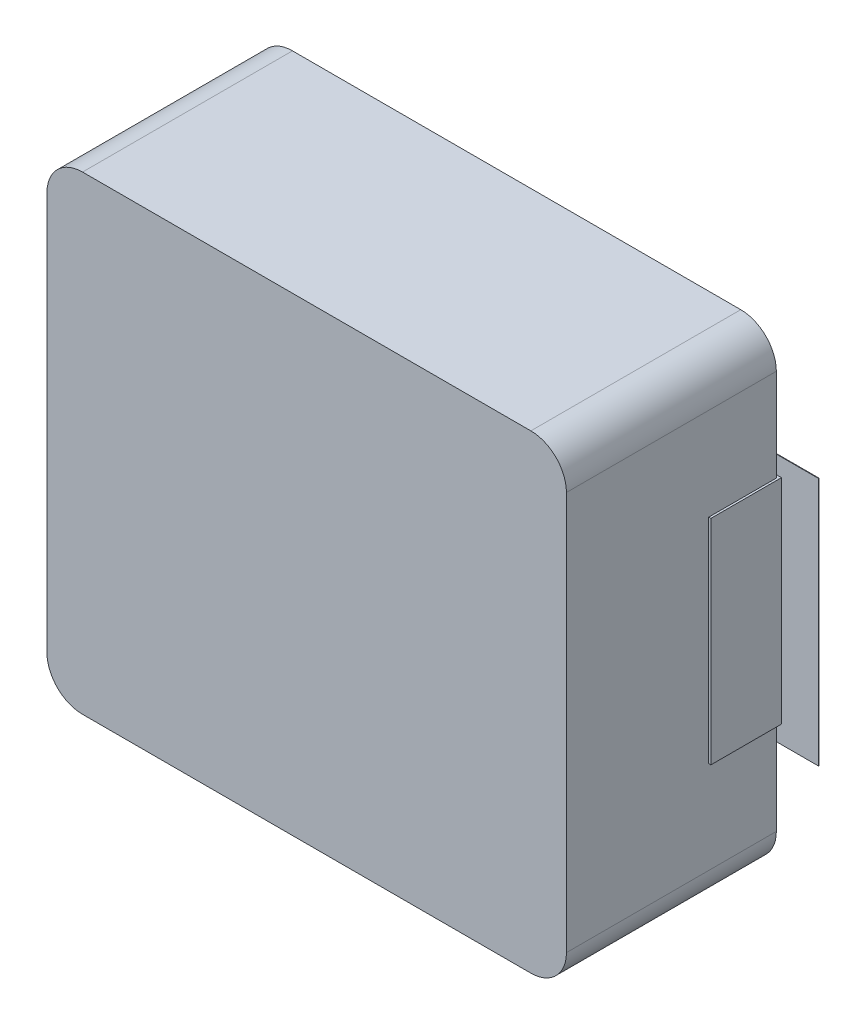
ISO-10303-21;
HEADER;
FILE_DESCRIPTION(('STEP AP214'),'2;1');
FILE_NAME('part.step','',(''),(''),'','','');
FILE_SCHEMA(('AUTOMOTIVE_DESIGN { 1 0 10303 214 1 1 1 1 }'));
ENDSEC;
DATA;
#1=APPLICATION_CONTEXT('core data for automotive mechanical design processes');
#2=APPLICATION_PROTOCOL_DEFINITION('international standard','automotive_design',2000,#1);
#3=PRODUCT_CONTEXT('',#1,'mechanical');
#4=PRODUCT('Part','Part','',(#3));
#5=PRODUCT_RELATED_PRODUCT_CATEGORY('part','',(#4));
#6=PRODUCT_DEFINITION_FORMATION('','',#4);
#7=PRODUCT_DEFINITION_CONTEXT('part definition',#1,'design');
#8=PRODUCT_DEFINITION('design','',#6,#7);
#9=PRODUCT_DEFINITION_SHAPE('','',#8);
#10=(LENGTH_UNIT() NAMED_UNIT(*) SI_UNIT(.MILLI.,.METRE.));
#11=(NAMED_UNIT(*) PLANE_ANGLE_UNIT() SI_UNIT($,.RADIAN.));
#12=(NAMED_UNIT(*) SI_UNIT($,.STERADIAN.) SOLID_ANGLE_UNIT());
#13=UNCERTAINTY_MEASURE_WITH_UNIT(LENGTH_MEASURE(1.E-05),#10,'distance_accuracy_value','');
#14=(GEOMETRIC_REPRESENTATION_CONTEXT(3) GLOBAL_UNCERTAINTY_ASSIGNED_CONTEXT((#13)) GLOBAL_UNIT_ASSIGNED_CONTEXT((#10,
#11,#12)) REPRESENTATION_CONTEXT('',''));
#15=CARTESIAN_POINT('',(0.,0.,0.));
#16=DIRECTION('',(0.,0.,1.));
#17=DIRECTION('',(1.,0.,0.));
#18=AXIS2_PLACEMENT_3D('',#15,#16,#17);
#19=CARTESIAN_POINT('',(0.,0.,0.0762));
#20=DIRECTION('',(0.,0.,1.));
#21=DIRECTION('',(1.,0.,0.));
#22=AXIS2_PLACEMENT_3D('',#19,#20,#21);
#23=PLANE('',#22);
#24=DIRECTION('',(1.,0.,0.));
#25=VECTOR('',#24,1.);
#26=CARTESIAN_POINT('',(-1.25000000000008,1.75000000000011,0.0762));
#27=LINE('',#26,#25);
#28=CARTESIAN_POINT('',(-1.25000000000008,1.75000000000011,0.0762));
#29=VERTEX_POINT('',#28);
#30=CARTESIAN_POINT('',(-4.20000000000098,1.75000000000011,0.0762));
#31=VERTEX_POINT('',#30);
#32=EDGE_CURVE('E198',#29,#31,#27,.F.);
#33=ORIENTED_EDGE('',*,*,#32,.F.);
#34=DIRECTION('',(0.,1.,0.));
#35=VECTOR('',#34,1.);
#36=CARTESIAN_POINT('',(-1.25000000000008,-1.75000000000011,0.0762));
#37=LINE('',#36,#35);
#38=CARTESIAN_POINT('',(-1.25000000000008,-1.75000000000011,0.0762));
#39=VERTEX_POINT('',#38);
#40=EDGE_CURVE('E203',#39,#29,#37,.T.);
#41=ORIENTED_EDGE('',*,*,#40,.F.);
#42=DIRECTION('',(1.,0.,0.));
#43=VECTOR('',#42,1.);
#44=CARTESIAN_POINT('',(-4.20000000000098,-1.75000000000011,0.0762));
#45=LINE('',#44,#43);
#46=CARTESIAN_POINT('',(-4.20000000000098,-1.75000000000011,0.0762));
#47=VERTEX_POINT('',#46);
#48=EDGE_CURVE('E295',#47,#39,#45,.T.);
#49=ORIENTED_EDGE('',*,*,#48,.F.);
#50=DIRECTION('',(0.,1.,0.));
#51=VECTOR('',#50,1.);
#52=CARTESIAN_POINT('',(-4.20000000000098,1.75000000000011,0.0762));
#53=LINE('',#52,#51);
#54=EDGE_CURVE('E213',#31,#47,#53,.F.);
#55=ORIENTED_EDGE('',*,*,#54,.F.);
#56=EDGE_LOOP('',(#33,#41,#49,#55));
#57=FACE_BOUND('',#56,.T.);
#58=ADVANCED_FACE('F16',(#57),#23,.F.);
#59=CARTESIAN_POINT('',(0.,0.,0.0762));
#60=DIRECTION('',(0.,0.,1.));
#61=DIRECTION('',(1.,0.,0.));
#62=AXIS2_PLACEMENT_3D('',#59,#60,#61);
#63=PLANE('',#62);
#64=DIRECTION('',(1.,0.,0.));
#65=VECTOR('',#64,1.);
#66=CARTESIAN_POINT('',(4.20000000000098,1.75000000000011,0.0762));
#67=LINE('',#66,#65);
#68=CARTESIAN_POINT('',(4.20000000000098,1.75000000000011,0.0762));
#69=VERTEX_POINT('',#68);
#70=CARTESIAN_POINT('',(1.25000000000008,1.75000000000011,0.0762));
#71=VERTEX_POINT('',#70);
#72=EDGE_CURVE('E288',#69,#71,#67,.F.);
#73=ORIENTED_EDGE('',*,*,#72,.F.);
#74=DIRECTION('',(0.,1.,0.));
#75=VECTOR('',#74,1.);
#76=CARTESIAN_POINT('',(4.20000000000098,-1.75000000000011,0.0762));
#77=LINE('',#76,#75);
#78=CARTESIAN_POINT('',(4.20000000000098,-1.75000000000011,0.0762));
#79=VERTEX_POINT('',#78);
#80=EDGE_CURVE('E293',#79,#69,#77,.T.);
#81=ORIENTED_EDGE('',*,*,#80,.F.);
#82=DIRECTION('',(1.,0.,0.));
#83=VECTOR('',#82,1.);
#84=CARTESIAN_POINT('',(1.25000000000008,-1.75000000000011,0.0762));
#85=LINE('',#84,#83);
#86=CARTESIAN_POINT('',(1.25000000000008,-1.75000000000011,0.0762));
#87=VERTEX_POINT('',#86);
#88=EDGE_CURVE('E273',#87,#79,#85,.T.);
#89=ORIENTED_EDGE('',*,*,#88,.F.);
#90=DIRECTION('',(0.,1.,0.));
#91=VECTOR('',#90,1.);
#92=CARTESIAN_POINT('',(1.25000000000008,1.75000000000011,0.0762));
#93=LINE('',#92,#91);
#94=EDGE_CURVE('E283',#71,#87,#93,.F.);
#95=ORIENTED_EDGE('',*,*,#94,.F.);
#96=EDGE_LOOP('',(#73,#81,#89,#95));
#97=FACE_BOUND('',#96,.T.);
#98=ADVANCED_FACE('F637',(#97),#63,.F.);
#99=CARTESIAN_POINT('',(-1.25000000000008,-1.75000000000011,0.0762));
#100=DIRECTION('',(1.,0.,0.));
#101=DIRECTION('',(0.,0.,-1.));
#102=AXIS2_PLACEMENT_3D('',#99,#100,#101);
#103=PLANE('',#102);
#104=DIRECTION('',(0.,0.,-1.));
#105=VECTOR('',#104,1.);
#106=CARTESIAN_POINT('',(-1.25000000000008,-1.75000000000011,0.0762));
#107=LINE('',#106,#105);
#108=CARTESIAN_POINT('',(-1.25000000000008,-1.75000000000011,0.0841999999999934));
#109=VERTEX_POINT('',#108);
#110=EDGE_CURVE('E208',#39,#109,#107,.F.);
#111=ORIENTED_EDGE('',*,*,#110,.F.);
#112=ORIENTED_EDGE('',*,*,#40,.T.);
#113=DIRECTION('',(0.,0.,1.));
#114=VECTOR('',#113,1.);
#115=CARTESIAN_POINT('',(-1.25000000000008,1.75000000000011,0.0762));
#116=LINE('',#115,#114);
#117=CARTESIAN_POINT('',(-1.25000000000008,1.75000000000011,0.0841999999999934));
#118=VERTEX_POINT('',#117);
#119=EDGE_CURVE('E205',#118,#29,#116,.F.);
#120=ORIENTED_EDGE('',*,*,#119,.F.);
#121=DIRECTION('',(0.,1.,0.));
#122=VECTOR('',#121,1.);
#123=CARTESIAN_POINT('',(-1.25000000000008,0.,0.0841999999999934));
#124=LINE('',#123,#122);
#125=EDGE_CURVE('E276',#109,#118,#124,.T.);
#126=ORIENTED_EDGE('',*,*,#125,.F.);
#127=EDGE_LOOP('',(#111,#112,#120,#126));
#128=FACE_BOUND('',#127,.T.);
#129=ADVANCED_FACE('F204',(#128),#103,.T.);
#130=CARTESIAN_POINT('',(-1.25000000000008,1.75000000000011,0.0762));
#131=DIRECTION('',(0.,1.,0.));
#132=DIRECTION('',(0.,0.,1.));
#133=AXIS2_PLACEMENT_3D('',#130,#131,#132);
#134=PLANE('',#133);
#135=ORIENTED_EDGE('',*,*,#119,.T.);
#136=ORIENTED_EDGE('',*,*,#32,.T.);
#137=DIRECTION('',(0.,0.,1.));
#138=VECTOR('',#137,1.);
#139=CARTESIAN_POINT('',(-4.20000000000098,1.75000000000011,0.0762));
#140=LINE('',#139,#138);
#141=CARTESIAN_POINT('',(-4.20000000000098,1.75000000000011,0.0841999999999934));
#142=VERTEX_POINT('',#141);
#143=EDGE_CURVE('E215',#142,#31,#140,.F.);
#144=ORIENTED_EDGE('',*,*,#143,.F.);
#145=DIRECTION('',(1.,0.,0.));
#146=VECTOR('',#145,1.);
#147=CARTESIAN_POINT('',(0.,1.75000000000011,0.0841999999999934));
#148=LINE('',#147,#146);
#149=EDGE_CURVE('E219',#118,#142,#148,.F.);
#150=ORIENTED_EDGE('',*,*,#149,.F.);
#151=EDGE_LOOP('',(#135,#136,#144,#150));
#152=FACE_BOUND('',#151,.T.);
#153=ADVANCED_FACE('F217',(#152),#134,.T.);
#154=CARTESIAN_POINT('',(-4.20000000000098,1.75000000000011,0.0762));
#155=DIRECTION('',(-1.,0.,0.));
#156=DIRECTION('',(0.,0.,1.));
#157=AXIS2_PLACEMENT_3D('',#154,#155,#156);
#158=PLANE('',#157);
#159=ORIENTED_EDGE('',*,*,#143,.T.);
#160=ORIENTED_EDGE('',*,*,#54,.T.);
#161=DIRECTION('',(0.,0.,-1.));
#162=VECTOR('',#161,1.);
#163=CARTESIAN_POINT('',(-4.20000000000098,-1.75000000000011,0.0762));
#164=LINE('',#163,#162);
#165=CARTESIAN_POINT('',(-4.20000000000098,-1.75000000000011,0.0841999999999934));
#166=VERTEX_POINT('',#165);
#167=EDGE_CURVE('E297',#166,#47,#164,.T.);
#168=ORIENTED_EDGE('',*,*,#167,.F.);
#169=DIRECTION('',(0.,1.,0.));
#170=VECTOR('',#169,1.);
#171=CARTESIAN_POINT('',(-4.20000000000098,0.,0.0841999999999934));
#172=LINE('',#171,#170);
#173=EDGE_CURVE('E305',#142,#166,#172,.F.);
#174=ORIENTED_EDGE('',*,*,#173,.F.);
#175=EDGE_LOOP('',(#159,#160,#168,#174));
#176=FACE_BOUND('',#175,.T.);
#177=ADVANCED_FACE('F303',(#176),#158,.T.);
#178=CARTESIAN_POINT('',(-4.20000000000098,-1.75000000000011,0.0762));
#179=DIRECTION('',(0.,-1.,0.));
#180=DIRECTION('',(0.,0.,-1.));
#181=AXIS2_PLACEMENT_3D('',#178,#179,#180);
#182=PLANE('',#181);
#183=ORIENTED_EDGE('',*,*,#167,.T.);
#184=ORIENTED_EDGE('',*,*,#48,.T.);
#185=ORIENTED_EDGE('',*,*,#110,.T.);
#186=DIRECTION('',(1.,0.,0.));
#187=VECTOR('',#186,1.);
#188=CARTESIAN_POINT('',(0.,-1.75000000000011,0.0841999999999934));
#189=LINE('',#188,#187);
#190=EDGE_CURVE('E309',#166,#109,#189,.T.);
#191=ORIENTED_EDGE('',*,*,#190,.F.);
#192=EDGE_LOOP('',(#183,#184,#185,#191));
#193=FACE_BOUND('',#192,.T.);
#194=ADVANCED_FACE('F421',(#193),#182,.T.);
#195=CARTESIAN_POINT('',(4.20000000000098,-1.75000000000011,0.0762));
#196=DIRECTION('',(1.,0.,0.));
#197=DIRECTION('',(0.,0.,-1.));
#198=AXIS2_PLACEMENT_3D('',#195,#196,#197);
#199=PLANE('',#198);
#200=DIRECTION('',(0.,0.,-1.));
#201=VECTOR('',#200,1.);
#202=CARTESIAN_POINT('',(4.20000000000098,-1.75000000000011,0.0762));
#203=LINE('',#202,#201);
#204=CARTESIAN_POINT('',(4.20000000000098,-1.75000000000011,0.0841999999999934));
#205=VERTEX_POINT('',#204);
#206=EDGE_CURVE('E280',#79,#205,#203,.F.);
#207=ORIENTED_EDGE('',*,*,#206,.F.);
#208=ORIENTED_EDGE('',*,*,#80,.T.);
#209=DIRECTION('',(0.,0.,1.));
#210=VECTOR('',#209,1.);
#211=CARTESIAN_POINT('',(4.20000000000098,1.75000000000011,0.0762));
#212=LINE('',#211,#210);
#213=CARTESIAN_POINT('',(4.20000000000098,1.75000000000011,0.0841999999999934));
#214=VERTEX_POINT('',#213);
#215=EDGE_CURVE('E290',#214,#69,#212,.F.);
#216=ORIENTED_EDGE('',*,*,#215,.F.);
#217=DIRECTION('',(0.,1.,0.));
#218=VECTOR('',#217,1.);
#219=CARTESIAN_POINT('',(4.20000000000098,0.,0.0841999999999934));
#220=LINE('',#219,#218);
#221=EDGE_CURVE('E389',#205,#214,#220,.T.);
#222=ORIENTED_EDGE('',*,*,#221,.F.);
#223=EDGE_LOOP('',(#207,#208,#216,#222));
#224=FACE_BOUND('',#223,.T.);
#225=ADVANCED_FACE('F423',(#224),#199,.T.);
#226=CARTESIAN_POINT('',(4.20000000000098,1.75000000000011,0.0762));
#227=DIRECTION('',(0.,1.,0.));
#228=DIRECTION('',(0.,0.,1.));
#229=AXIS2_PLACEMENT_3D('',#226,#227,#228);
#230=PLANE('',#229);
#231=ORIENTED_EDGE('',*,*,#215,.T.);
#232=ORIENTED_EDGE('',*,*,#72,.T.);
#233=DIRECTION('',(0.,0.,1.));
#234=VECTOR('',#233,1.);
#235=CARTESIAN_POINT('',(1.25000000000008,1.75000000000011,0.0762));
#236=LINE('',#235,#234);
#237=CARTESIAN_POINT('',(1.25000000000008,1.75000000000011,0.0841999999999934));
#238=VERTEX_POINT('',#237);
#239=EDGE_CURVE('E285',#238,#71,#236,.F.);
#240=ORIENTED_EDGE('',*,*,#239,.F.);
#241=DIRECTION('',(1.,0.,0.));
#242=VECTOR('',#241,1.);
#243=CARTESIAN_POINT('',(0.,1.75000000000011,0.0841999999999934));
#244=LINE('',#243,#242);
#245=EDGE_CURVE('E386',#214,#238,#244,.F.);
#246=ORIENTED_EDGE('',*,*,#245,.F.);
#247=EDGE_LOOP('',(#231,#232,#240,#246));
#248=FACE_BOUND('',#247,.T.);
#249=ADVANCED_FACE('F430',(#248),#230,.T.);
#250=CARTESIAN_POINT('',(1.25000000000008,1.75000000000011,0.0762));
#251=DIRECTION('',(-1.,0.,0.));
#252=DIRECTION('',(0.,0.,1.));
#253=AXIS2_PLACEMENT_3D('',#250,#251,#252);
#254=PLANE('',#253);
#255=ORIENTED_EDGE('',*,*,#239,.T.);
#256=ORIENTED_EDGE('',*,*,#94,.T.);
#257=DIRECTION('',(0.,0.,-1.));
#258=VECTOR('',#257,1.);
#259=CARTESIAN_POINT('',(1.25000000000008,-1.75000000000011,0.0762));
#260=LINE('',#259,#258);
#261=CARTESIAN_POINT('',(1.25000000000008,-1.75000000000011,0.0841999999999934));
#262=VERTEX_POINT('',#261);
#263=EDGE_CURVE('E277',#262,#87,#260,.T.);
#264=ORIENTED_EDGE('',*,*,#263,.F.);
#265=DIRECTION('',(0.,1.,0.));
#266=VECTOR('',#265,1.);
#267=CARTESIAN_POINT('',(1.25000000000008,0.,0.0841999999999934));
#268=LINE('',#267,#266);
#269=EDGE_CURVE('E383',#238,#262,#268,.F.);
#270=ORIENTED_EDGE('',*,*,#269,.F.);
#271=EDGE_LOOP('',(#255,#256,#264,#270));
#272=FACE_BOUND('',#271,.T.);
#273=ADVANCED_FACE('F519',(#272),#254,.T.);
#274=CARTESIAN_POINT('',(1.25000000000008,-1.75000000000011,0.0762));
#275=DIRECTION('',(0.,-1.,0.));
#276=DIRECTION('',(0.,0.,-1.));
#277=AXIS2_PLACEMENT_3D('',#274,#275,#276);
#278=PLANE('',#277);
#279=ORIENTED_EDGE('',*,*,#263,.T.);
#280=ORIENTED_EDGE('',*,*,#88,.T.);
#281=ORIENTED_EDGE('',*,*,#206,.T.);
#282=DIRECTION('',(1.,0.,0.));
#283=VECTOR('',#282,1.);
#284=CARTESIAN_POINT('',(0.,-1.75000000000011,0.0841999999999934));
#285=LINE('',#284,#283);
#286=EDGE_CURVE('E380',#262,#205,#285,.T.);
#287=ORIENTED_EDGE('',*,*,#286,.F.);
#288=EDGE_LOOP('',(#279,#280,#281,#287));
#289=FACE_BOUND('',#288,.T.);
#290=ADVANCED_FACE('F515',(#289),#278,.T.);
#291=CARTESIAN_POINT('',(0.,0.,0.0841999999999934));
#292=DIRECTION('',(0.,0.,1.));
#293=DIRECTION('',(1.,0.,0.));
#294=AXIS2_PLACEMENT_3D('',#291,#292,#293);
#295=PLANE('',#294);
#296=DIRECTION('',(0.,1.,0.));
#297=VECTOR('',#296,1.);
#298=CARTESIAN_POINT('',(-1.8800000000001,-1.5000000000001,0.0841999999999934));
#299=LINE('',#298,#297);
#300=CARTESIAN_POINT('',(-1.8800000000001,-1.5000000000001,0.0841999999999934));
#301=VERTEX_POINT('',#300);
#302=CARTESIAN_POINT('',(-1.8800000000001,1.5000000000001,0.0841999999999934));
#303=VERTEX_POINT('',#302);
#304=EDGE_CURVE('E327',#301,#303,#299,.T.);
#305=ORIENTED_EDGE('',*,*,#304,.F.);
#306=DIRECTION('',(1.,0.,0.));
#307=VECTOR('',#306,1.);
#308=CARTESIAN_POINT('',(-3.68000000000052,-1.5000000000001,0.0841999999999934));
#309=LINE('',#308,#307);
#310=CARTESIAN_POINT('',(-3.68000000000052,-1.5000000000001,0.0841999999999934));
#311=VERTEX_POINT('',#310);
#312=EDGE_CURVE('E269',#311,#301,#309,.T.);
#313=ORIENTED_EDGE('',*,*,#312,.F.);
#314=DIRECTION('',(0.,1.,0.));
#315=VECTOR('',#314,1.);
#316=CARTESIAN_POINT('',(-3.68000000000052,1.5000000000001,0.0841999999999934));
#317=LINE('',#316,#315);
#318=CARTESIAN_POINT('',(-3.68000000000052,1.5000000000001,0.0841999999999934));
#319=VERTEX_POINT('',#318);
#320=EDGE_CURVE('E352',#319,#311,#317,.F.);
#321=ORIENTED_EDGE('',*,*,#320,.F.);
#322=DIRECTION('',(1.,0.,0.));
#323=VECTOR('',#322,1.);
#324=CARTESIAN_POINT('',(-1.8800000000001,1.5000000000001,0.0841999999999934));
#325=LINE('',#324,#323);
#326=EDGE_CURVE('E339',#303,#319,#325,.F.);
#327=ORIENTED_EDGE('',*,*,#326,.F.);
#328=EDGE_LOOP('',(#305,#313,#321,#327));
#329=FACE_BOUND('',#328,.T.);
#330=ORIENTED_EDGE('',*,*,#173,.T.);
#331=ORIENTED_EDGE('',*,*,#190,.T.);
#332=ORIENTED_EDGE('',*,*,#125,.T.);
#333=ORIENTED_EDGE('',*,*,#149,.T.);
#334=EDGE_LOOP('',(#330,#331,#332,#333));
#335=FACE_BOUND('',#334,.T.);
#336=ADVANCED_FACE('F311',(#329,#335),#295,.T.);
#337=CARTESIAN_POINT('',(0.,0.,0.0841999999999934));
#338=DIRECTION('',(0.,0.,1.));
#339=DIRECTION('',(1.,0.,0.));
#340=AXIS2_PLACEMENT_3D('',#337,#338,#339);
#341=PLANE('',#340);
#342=DIRECTION('',(1.,0.,0.));
#343=VECTOR('',#342,1.);
#344=CARTESIAN_POINT('',(3.68000000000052,1.5000000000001,0.0841999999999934));
#345=LINE('',#344,#343);
#346=CARTESIAN_POINT('',(3.68000000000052,1.5000000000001,0.0841999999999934));
#347=VERTEX_POINT('',#346);
#348=CARTESIAN_POINT('',(1.8800000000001,1.5000000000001,0.0841999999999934));
#349=VERTEX_POINT('',#348);
#350=EDGE_CURVE('E347',#347,#349,#345,.F.);
#351=ORIENTED_EDGE('',*,*,#350,.F.);
#352=DIRECTION('',(0.,1.,0.));
#353=VECTOR('',#352,1.);
#354=CARTESIAN_POINT('',(3.68000000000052,-1.5000000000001,0.0841999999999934));
#355=LINE('',#354,#353);
#356=CARTESIAN_POINT('',(3.68000000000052,-1.5000000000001,0.0841999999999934));
#357=VERTEX_POINT('',#356);
#358=EDGE_CURVE('E355',#357,#347,#355,.T.);
#359=ORIENTED_EDGE('',*,*,#358,.F.);
#360=DIRECTION('',(1.,0.,0.));
#361=VECTOR('',#360,1.);
#362=CARTESIAN_POINT('',(1.8800000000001,-1.5000000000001,0.0841999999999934));
#363=LINE('',#362,#361);
#364=CARTESIAN_POINT('',(1.8800000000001,-1.5000000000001,0.0841999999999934));
#365=VERTEX_POINT('',#364);
#366=EDGE_CURVE('E398',#365,#357,#363,.T.);
#367=ORIENTED_EDGE('',*,*,#366,.F.);
#368=DIRECTION('',(0.,1.,0.));
#369=VECTOR('',#368,1.);
#370=CARTESIAN_POINT('',(1.8800000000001,1.5000000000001,0.0841999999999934));
#371=LINE('',#370,#369);
#372=EDGE_CURVE('E376',#349,#365,#371,.F.);
#373=ORIENTED_EDGE('',*,*,#372,.F.);
#374=EDGE_LOOP('',(#351,#359,#367,#373));
#375=FACE_BOUND('',#374,.T.);
#376=ORIENTED_EDGE('',*,*,#269,.T.);
#377=ORIENTED_EDGE('',*,*,#286,.T.);
#378=ORIENTED_EDGE('',*,*,#221,.T.);
#379=ORIENTED_EDGE('',*,*,#245,.T.);
#380=EDGE_LOOP('',(#376,#377,#378,#379));
#381=FACE_BOUND('',#380,.T.);
#382=ADVANCED_FACE('F508',(#375,#381),#341,.T.);
#383=CARTESIAN_POINT('',(3.68000000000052,-1.5000000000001,0.0762));
#384=DIRECTION('',(1.,0.,0.));
#385=DIRECTION('',(0.,0.,-1.));
#386=AXIS2_PLACEMENT_3D('',#383,#384,#385);
#387=PLANE('',#386);
#388=DIRECTION('',(0.,0.,-1.));
#389=VECTOR('',#388,1.);
#390=CARTESIAN_POINT('',(3.68000000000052,-1.5000000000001,0.0762));
#391=LINE('',#390,#389);
#392=CARTESIAN_POINT('',(3.68000000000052,-1.5000000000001,1.07620000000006));
#393=VERTEX_POINT('',#392);
#394=EDGE_CURVE('E336',#357,#393,#391,.F.);
#395=ORIENTED_EDGE('',*,*,#394,.F.);
#396=ORIENTED_EDGE('',*,*,#358,.T.);
#397=DIRECTION('',(0.,0.,1.));
#398=VECTOR('',#397,1.);
#399=CARTESIAN_POINT('',(3.68000000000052,1.5000000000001,0.0762));
#400=LINE('',#399,#398);
#401=CARTESIAN_POINT('',(3.68000000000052,1.5000000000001,1.07620000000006));
#402=VERTEX_POINT('',#401);
#403=EDGE_CURVE('E361',#402,#347,#400,.F.);
#404=ORIENTED_EDGE('',*,*,#403,.F.);
#405=DIRECTION('',(0.,1.,0.));
#406=VECTOR('',#405,1.);
#407=CARTESIAN_POINT('',(3.68000000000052,0.,1.07620000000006));
#408=LINE('',#407,#406);
#409=EDGE_CURVE('E251',#393,#402,#408,.T.);
#410=ORIENTED_EDGE('',*,*,#409,.F.);
#411=EDGE_LOOP('',(#395,#396,#404,#410));
#412=FACE_BOUND('',#411,.T.);
#413=ADVANCED_FACE('F504',(#412),#387,.T.);
#414=CARTESIAN_POINT('',(-3.68000000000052,1.5000000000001,0.0762));
#415=DIRECTION('',(-1.,0.,0.));
#416=DIRECTION('',(0.,0.,1.));
#417=AXIS2_PLACEMENT_3D('',#414,#415,#416);
#418=PLANE('',#417);
#419=DIRECTION('',(0.,0.,1.));
#420=VECTOR('',#419,1.);
#421=CARTESIAN_POINT('',(-3.68000000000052,1.5000000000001,0.0762));
#422=LINE('',#421,#420);
#423=CARTESIAN_POINT('',(-3.68000000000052,1.5000000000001,1.07620000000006));
#424=VERTEX_POINT('',#423);
#425=EDGE_CURVE('E345',#319,#424,#422,.T.);
#426=ORIENTED_EDGE('',*,*,#425,.F.);
#427=ORIENTED_EDGE('',*,*,#320,.T.);
#428=DIRECTION('',(0.,0.,-1.));
#429=VECTOR('',#428,1.);
#430=CARTESIAN_POINT('',(-3.68000000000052,-1.5000000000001,0.0762));
#431=LINE('',#430,#429);
#432=CARTESIAN_POINT('',(-3.68000000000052,-1.5000000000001,1.07620000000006));
#433=VERTEX_POINT('',#432);
#434=EDGE_CURVE('E266',#433,#311,#431,.T.);
#435=ORIENTED_EDGE('',*,*,#434,.F.);
#436=DIRECTION('',(0.,1.,0.));
#437=VECTOR('',#436,1.);
#438=CARTESIAN_POINT('',(-3.68000000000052,0.,1.07620000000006));
#439=LINE('',#438,#437);
#440=EDGE_CURVE('E247',#424,#433,#439,.F.);
#441=ORIENTED_EDGE('',*,*,#440,.F.);
#442=EDGE_LOOP('',(#426,#427,#435,#441));
#443=FACE_BOUND('',#442,.T.);
#444=ADVANCED_FACE('F501',(#443),#418,.T.);
#445=CARTESIAN_POINT('',(3.68000000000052,1.5000000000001,0.0762));
#446=DIRECTION('',(0.,1.,0.));
#447=DIRECTION('',(0.,0.,1.));
#448=AXIS2_PLACEMENT_3D('',#445,#446,#447);
#449=PLANE('',#448);
#450=ORIENTED_EDGE('',*,*,#403,.T.);
#451=ORIENTED_EDGE('',*,*,#350,.T.);
#452=DIRECTION('',(0.,0.,1.));
#453=VECTOR('',#452,1.);
#454=CARTESIAN_POINT('',(1.8800000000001,1.5000000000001,0.0762));
#455=LINE('',#454,#453);
#456=CARTESIAN_POINT('',(1.8800000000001,1.5000000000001,0.126200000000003));
#457=VERTEX_POINT('',#456);
#458=EDGE_CURVE('E373',#457,#349,#455,.F.);
#459=ORIENTED_EDGE('',*,*,#458,.F.);
#460=DIRECTION('',(1.,0.,0.));
#461=VECTOR('',#460,1.);
#462=CARTESIAN_POINT('',(0.,1.5000000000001,0.126200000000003));
#463=LINE('',#462,#461);
#464=CARTESIAN_POINT('',(3.65000000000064,1.5000000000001,0.126200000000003));
#465=VERTEX_POINT('',#464);
#466=EDGE_CURVE('E237',#457,#465,#463,.T.);
#467=ORIENTED_EDGE('',*,*,#466,.T.);
#468=DIRECTION('',(0.,0.,1.));
#469=VECTOR('',#468,1.);
#470=CARTESIAN_POINT('',(3.65000000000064,1.5000000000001,0.0762));
#471=LINE('',#470,#469);
#472=CARTESIAN_POINT('',(3.65000000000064,1.5000000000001,1.07620000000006));
#473=VERTEX_POINT('',#472);
#474=EDGE_CURVE('E354',#465,#473,#471,.T.);
#475=ORIENTED_EDGE('',*,*,#474,.T.);
#476=DIRECTION('',(1.,0.,0.));
#477=VECTOR('',#476,1.);
#478=CARTESIAN_POINT('',(0.,1.5000000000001,1.07620000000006));
#479=LINE('',#478,#477);
#480=EDGE_CURVE('E249',#402,#473,#479,.F.);
#481=ORIENTED_EDGE('',*,*,#480,.F.);
#482=EDGE_LOOP('',(#450,#451,#459,#467,#475,#481));
#483=FACE_BOUND('',#482,.T.);
#484=ADVANCED_FACE('F497',(#483),#449,.T.);
#485=CARTESIAN_POINT('',(-1.8800000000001,1.5000000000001,0.0762));
#486=DIRECTION('',(0.,1.,0.));
#487=DIRECTION('',(0.,0.,1.));
#488=AXIS2_PLACEMENT_3D('',#485,#486,#487);
#489=PLANE('',#488);
#490=DIRECTION('',(0.,0.,-1.));
#491=VECTOR('',#490,1.);
#492=CARTESIAN_POINT('',(-1.8800000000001,1.5000000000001,0.0762));
#493=LINE('',#492,#491);
#494=CARTESIAN_POINT('',(-1.8800000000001,1.5000000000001,0.126200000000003));
#495=VERTEX_POINT('',#494);
#496=EDGE_CURVE('E331',#303,#495,#493,.F.);
#497=ORIENTED_EDGE('',*,*,#496,.F.);
#498=ORIENTED_EDGE('',*,*,#326,.T.);
#499=ORIENTED_EDGE('',*,*,#425,.T.);
#500=DIRECTION('',(1.,0.,0.));
#501=VECTOR('',#500,1.);
#502=CARTESIAN_POINT('',(0.,1.5000000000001,1.07620000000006));
#503=LINE('',#502,#501);
#504=CARTESIAN_POINT('',(-3.65000000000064,1.5000000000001,1.07620000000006));
#505=VERTEX_POINT('',#504);
#506=EDGE_CURVE('E241',#505,#424,#503,.F.);
#507=ORIENTED_EDGE('',*,*,#506,.F.);
#508=DIRECTION('',(0.,0.,1.));
#509=VECTOR('',#508,1.);
#510=CARTESIAN_POINT('',(-3.65000000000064,1.5000000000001,0.0762));
#511=LINE('',#510,#509);
#512=CARTESIAN_POINT('',(-3.65000000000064,1.5000000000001,0.126200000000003));
#513=VERTEX_POINT('',#512);
#514=EDGE_CURVE('E342',#505,#513,#511,.F.);
#515=ORIENTED_EDGE('',*,*,#514,.T.);
#516=DIRECTION('',(1.,0.,0.));
#517=VECTOR('',#516,1.);
#518=CARTESIAN_POINT('',(0.,1.5000000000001,0.126200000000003));
#519=LINE('',#518,#517);
#520=EDGE_CURVE('E234',#513,#495,#519,.T.);
#521=ORIENTED_EDGE('',*,*,#520,.T.);
#522=EDGE_LOOP('',(#497,#498,#499,#507,#515,#521));
#523=FACE_BOUND('',#522,.T.);
#524=ADVANCED_FACE('F493',(#523),#489,.T.);
#525=CARTESIAN_POINT('',(-1.8800000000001,-1.5000000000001,0.0762));
#526=DIRECTION('',(1.,0.,0.));
#527=DIRECTION('',(0.,0.,-1.));
#528=AXIS2_PLACEMENT_3D('',#525,#526,#527);
#529=PLANE('',#528);
#530=DIRECTION('',(0.,0.,-1.));
#531=VECTOR('',#530,1.);
#532=CARTESIAN_POINT('',(-1.8800000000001,-1.5000000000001,0.0762));
#533=LINE('',#532,#531);
#534=CARTESIAN_POINT('',(-1.8800000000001,-1.5000000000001,0.126200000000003));
#535=VERTEX_POINT('',#534);
#536=EDGE_CURVE('E330',#301,#535,#533,.F.);
#537=ORIENTED_EDGE('',*,*,#536,.F.);
#538=ORIENTED_EDGE('',*,*,#304,.T.);
#539=ORIENTED_EDGE('',*,*,#496,.T.);
#540=DIRECTION('',(0.,1.,0.));
#541=VECTOR('',#540,1.);
#542=CARTESIAN_POINT('',(-1.8800000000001,0.,0.126200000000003));
#543=LINE('',#542,#541);
#544=EDGE_CURVE('E565',#495,#535,#543,.F.);
#545=ORIENTED_EDGE('',*,*,#544,.T.);
#546=EDGE_LOOP('',(#537,#538,#539,#545));
#547=FACE_BOUND('',#546,.T.);
#548=ADVANCED_FACE('F489',(#547),#529,.T.);
#549=CARTESIAN_POINT('',(-3.68000000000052,-1.5000000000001,0.0762));
#550=DIRECTION('',(0.,-1.,0.));
#551=DIRECTION('',(0.,0.,-1.));
#552=AXIS2_PLACEMENT_3D('',#549,#550,#551);
#553=PLANE('',#552);
#554=ORIENTED_EDGE('',*,*,#434,.T.);
#555=ORIENTED_EDGE('',*,*,#312,.T.);
#556=ORIENTED_EDGE('',*,*,#536,.T.);
#557=DIRECTION('',(1.,0.,0.));
#558=VECTOR('',#557,1.);
#559=CARTESIAN_POINT('',(0.,-1.5000000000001,0.126200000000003));
#560=LINE('',#559,#558);
#561=CARTESIAN_POINT('',(-3.65000000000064,-1.5000000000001,0.126200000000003));
#562=VERTEX_POINT('',#561);
#563=EDGE_CURVE('E231',#535,#562,#560,.F.);
#564=ORIENTED_EDGE('',*,*,#563,.T.);
#565=DIRECTION('',(0.,0.,-1.));
#566=VECTOR('',#565,1.);
#567=CARTESIAN_POINT('',(-3.65000000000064,-1.5000000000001,0.0762));
#568=LINE('',#567,#566);
#569=CARTESIAN_POINT('',(-3.65000000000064,-1.5000000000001,1.07620000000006));
#570=VERTEX_POINT('',#569);
#571=EDGE_CURVE('E270',#562,#570,#568,.F.);
#572=ORIENTED_EDGE('',*,*,#571,.T.);
#573=DIRECTION('',(1.,0.,0.));
#574=VECTOR('',#573,1.);
#575=CARTESIAN_POINT('',(0.,-1.5000000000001,1.07620000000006));
#576=LINE('',#575,#574);
#577=EDGE_CURVE('E239',#433,#570,#576,.T.);
#578=ORIENTED_EDGE('',*,*,#577,.F.);
#579=EDGE_LOOP('',(#554,#555,#556,#564,#572,#578));
#580=FACE_BOUND('',#579,.T.);
#581=ADVANCED_FACE('F486',(#580),#553,.T.);
#582=CARTESIAN_POINT('',(1.8800000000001,-1.5000000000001,0.0762));
#583=DIRECTION('',(0.,-1.,0.));
#584=DIRECTION('',(0.,0.,-1.));
#585=AXIS2_PLACEMENT_3D('',#582,#583,#584);
#586=PLANE('',#585);
#587=DIRECTION('',(0.,0.,1.));
#588=VECTOR('',#587,1.);
#589=CARTESIAN_POINT('',(1.8800000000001,-1.5000000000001,0.0762));
#590=LINE('',#589,#588);
#591=CARTESIAN_POINT('',(1.8800000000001,-1.5000000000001,0.126200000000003));
#592=VERTEX_POINT('',#591);
#593=EDGE_CURVE('E377',#365,#592,#590,.T.);
#594=ORIENTED_EDGE('',*,*,#593,.F.);
#595=ORIENTED_EDGE('',*,*,#366,.T.);
#596=ORIENTED_EDGE('',*,*,#394,.T.);
#597=DIRECTION('',(1.,0.,0.));
#598=VECTOR('',#597,1.);
#599=CARTESIAN_POINT('',(0.,-1.5000000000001,1.07620000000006));
#600=LINE('',#599,#598);
#601=CARTESIAN_POINT('',(3.65000000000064,-1.5000000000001,1.07620000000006));
#602=VERTEX_POINT('',#601);
#603=EDGE_CURVE('E258',#602,#393,#600,.T.);
#604=ORIENTED_EDGE('',*,*,#603,.F.);
#605=DIRECTION('',(0.,0.,-1.));
#606=VECTOR('',#605,1.);
#607=CARTESIAN_POINT('',(3.65000000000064,-1.5000000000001,0.0762));
#608=LINE('',#607,#606);
#609=CARTESIAN_POINT('',(3.65000000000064,-1.5000000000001,0.126200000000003));
#610=VERTEX_POINT('',#609);
#611=EDGE_CURVE('E103',#602,#610,#608,.T.);
#612=ORIENTED_EDGE('',*,*,#611,.T.);
#613=DIRECTION('',(1.,0.,0.));
#614=VECTOR('',#613,1.);
#615=CARTESIAN_POINT('',(0.,-1.5000000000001,0.126200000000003));
#616=LINE('',#615,#614);
#617=EDGE_CURVE('E230',#610,#592,#616,.F.);
#618=ORIENTED_EDGE('',*,*,#617,.T.);
#619=EDGE_LOOP('',(#594,#595,#596,#604,#612,#618));
#620=FACE_BOUND('',#619,.T.);
#621=ADVANCED_FACE('F482',(#620),#586,.T.);
#622=CARTESIAN_POINT('',(1.8800000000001,1.5000000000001,0.0762));
#623=DIRECTION('',(-1.,0.,0.));
#624=DIRECTION('',(0.,0.,1.));
#625=AXIS2_PLACEMENT_3D('',#622,#623,#624);
#626=PLANE('',#625);
#627=ORIENTED_EDGE('',*,*,#458,.T.);
#628=ORIENTED_EDGE('',*,*,#372,.T.);
#629=ORIENTED_EDGE('',*,*,#593,.T.);
#630=DIRECTION('',(0.,1.,0.));
#631=VECTOR('',#630,1.);
#632=CARTESIAN_POINT('',(1.8800000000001,0.,0.126200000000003));
#633=LINE('',#632,#631);
#634=EDGE_CURVE('E227',#592,#457,#633,.T.);
#635=ORIENTED_EDGE('',*,*,#634,.T.);
#636=EDGE_LOOP('',(#627,#628,#629,#635));
#637=FACE_BOUND('',#636,.T.);
#638=ADVANCED_FACE('F479',(#637),#626,.T.);
#639=CARTESIAN_POINT('',(0.,0.,1.07620000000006));
#640=DIRECTION('',(0.,0.,1.));
#641=DIRECTION('',(1.,0.,0.));
#642=AXIS2_PLACEMENT_3D('',#639,#640,#641);
#643=PLANE('',#642);
#644=ORIENTED_EDGE('',*,*,#480,.T.);
#645=DIRECTION('',(0.,1.,0.));
#646=VECTOR('',#645,1.);
#647=CARTESIAN_POINT('',(3.65000000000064,-3.2999999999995,1.07620000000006));
#648=LINE('',#647,#646);
#649=EDGE_CURVE('E410',#602,#473,#648,.T.);
#650=ORIENTED_EDGE('',*,*,#649,.F.);
#651=ORIENTED_EDGE('',*,*,#603,.T.);
#652=ORIENTED_EDGE('',*,*,#409,.T.);
#653=EDGE_LOOP('',(#644,#650,#651,#652));
#654=FACE_BOUND('',#653,.T.);
#655=ADVANCED_FACE('F476',(#654),#643,.T.);
#656=CARTESIAN_POINT('',(3.1500000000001,2.79999999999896,6.9869861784));
#657=DIRECTION('',(0.,0.,-1.));
#658=DIRECTION('',(-1.,0.,0.));
#659=AXIS2_PLACEMENT_3D('',#656,#657,#658);
#660=CYLINDRICAL_SURFACE('',#659,0.500000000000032);
#661=DIRECTION('',(0.,0.,-1.));
#662=VECTOR('',#661,1.);
#663=CARTESIAN_POINT('',(3.65000000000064,2.79999999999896,0.0762));
#664=LINE('',#663,#662);
#665=CARTESIAN_POINT('',(3.65000000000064,2.79999999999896,0.126200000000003));
#666=VERTEX_POINT('',#665);
#667=CARTESIAN_POINT('',(3.65000000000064,2.79999999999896,3.076194));
#668=VERTEX_POINT('',#667);
#669=EDGE_CURVE('E616',#666,#668,#664,.F.);
#670=ORIENTED_EDGE('',*,*,#669,.F.);
#671=CARTESIAN_POINT('',(3.1500000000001,2.79999999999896,0.126200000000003));
#672=DIRECTION('',(0.,0.,-1.));
#673=DIRECTION('',(-1.,0.,0.));
#674=AXIS2_PLACEMENT_3D('',#671,#672,#673);
#675=CIRCLE('',#674,0.500000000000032);
#676=CARTESIAN_POINT('',(3.1500000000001,3.2999999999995,0.126200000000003));
#677=VERTEX_POINT('',#676);
#678=EDGE_CURVE('E235',#666,#677,#675,.F.);
#679=ORIENTED_EDGE('',*,*,#678,.T.);
#680=DIRECTION('',(0.,0.,1.));
#681=VECTOR('',#680,1.);
#682=CARTESIAN_POINT('',(3.1500000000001,3.2999999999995,0.0762));
#683=LINE('',#682,#681);
#684=CARTESIAN_POINT('',(3.1500000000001,3.2999999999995,3.076194));
#685=VERTEX_POINT('',#684);
#686=EDGE_CURVE('E412',#685,#677,#683,.F.);
#687=ORIENTED_EDGE('',*,*,#686,.F.);
#688=CARTESIAN_POINT('',(3.1500000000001,2.79999999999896,3.076194));
#689=DIRECTION('',(0.,0.,-1.));
#690=DIRECTION('',(-1.,0.,0.));
#691=AXIS2_PLACEMENT_3D('',#688,#689,#690);
#692=CIRCLE('',#691,0.500000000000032);
#693=EDGE_CURVE('E19',#685,#668,#692,.T.);
#694=ORIENTED_EDGE('',*,*,#693,.T.);
#695=EDGE_LOOP('',(#670,#679,#687,#694));
#696=FACE_BOUND('',#695,.T.);
#697=ADVANCED_FACE('F473',(#696),#660,.T.);
#698=CARTESIAN_POINT('',(-3.1500000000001,2.79999999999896,6.9869861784));
#699=DIRECTION('',(0.,0.,-1.));
#700=DIRECTION('',(-1.,0.,0.));
#701=AXIS2_PLACEMENT_3D('',#698,#699,#700);
#702=CYLINDRICAL_SURFACE('',#701,0.500000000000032);
#703=DIRECTION('',(0.,0.,1.));
#704=VECTOR('',#703,1.);
#705=CARTESIAN_POINT('',(-3.1500000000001,3.2999999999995,0.0762));
#706=LINE('',#705,#704);
#707=CARTESIAN_POINT('',(-3.1500000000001,3.2999999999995,0.126200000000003));
#708=VERTEX_POINT('',#707);
#709=CARTESIAN_POINT('',(-3.1500000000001,3.2999999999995,3.076194));
#710=VERTEX_POINT('',#709);
#711=EDGE_CURVE('E598',#708,#710,#706,.T.);
#712=ORIENTED_EDGE('',*,*,#711,.F.);
#713=CARTESIAN_POINT('',(-3.1500000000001,2.79999999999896,0.126200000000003));
#714=DIRECTION('',(0.,0.,-1.));
#715=DIRECTION('',(-1.,0.,0.));
#716=AXIS2_PLACEMENT_3D('',#713,#714,#715);
#717=CIRCLE('',#716,0.500000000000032);
#718=CARTESIAN_POINT('',(-3.65000000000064,2.79999999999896,0.126200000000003));
#719=VERTEX_POINT('',#718);
#720=EDGE_CURVE('E232',#708,#719,#717,.F.);
#721=ORIENTED_EDGE('',*,*,#720,.T.);
#722=DIRECTION('',(0.,0.,1.));
#723=VECTOR('',#722,1.);
#724=CARTESIAN_POINT('',(-3.65000000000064,2.79999999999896,0.0762));
#725=LINE('',#724,#723);
#726=CARTESIAN_POINT('',(-3.65000000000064,2.79999999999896,3.076194));
#727=VERTEX_POINT('',#726);
#728=EDGE_CURVE('E583',#727,#719,#725,.F.);
#729=ORIENTED_EDGE('',*,*,#728,.F.);
#730=CARTESIAN_POINT('',(-3.1500000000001,2.79999999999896,3.076194));
#731=DIRECTION('',(0.,0.,-1.));
#732=DIRECTION('',(-1.,0.,0.));
#733=AXIS2_PLACEMENT_3D('',#730,#731,#732);
#734=CIRCLE('',#733,0.500000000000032);
#735=EDGE_CURVE('E240',#727,#710,#734,.T.);
#736=ORIENTED_EDGE('',*,*,#735,.T.);
#737=EDGE_LOOP('',(#712,#721,#729,#736));
#738=FACE_BOUND('',#737,.T.);
#739=ADVANCED_FACE('F469',(#738),#702,.T.);
#740=CARTESIAN_POINT('',(0.,0.,1.07620000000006));
#741=DIRECTION('',(0.,0.,1.));
#742=DIRECTION('',(1.,0.,0.));
#743=AXIS2_PLACEMENT_3D('',#740,#741,#742);
#744=PLANE('',#743);
#745=ORIENTED_EDGE('',*,*,#577,.T.);
#746=DIRECTION('',(0.,1.,0.));
#747=VECTOR('',#746,1.);
#748=CARTESIAN_POINT('',(-3.65000000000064,3.2999999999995,1.07620000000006));
#749=LINE('',#748,#747);
#750=EDGE_CURVE('E320',#505,#570,#749,.F.);
#751=ORIENTED_EDGE('',*,*,#750,.F.);
#752=ORIENTED_EDGE('',*,*,#506,.T.);
#753=ORIENTED_EDGE('',*,*,#440,.T.);
#754=EDGE_LOOP('',(#745,#751,#752,#753));
#755=FACE_BOUND('',#754,.T.);
#756=ADVANCED_FACE('F465',(#755),#744,.T.);
#757=CARTESIAN_POINT('',(-3.1500000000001,-2.79999999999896,6.9869861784));
#758=DIRECTION('',(0.,0.,-1.));
#759=DIRECTION('',(-1.,0.,0.));
#760=AXIS2_PLACEMENT_3D('',#757,#758,#759);
#761=CYLINDRICAL_SURFACE('',#760,0.500000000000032);
#762=DIRECTION('',(0.,0.,1.));
#763=VECTOR('',#762,1.);
#764=CARTESIAN_POINT('',(-3.65000000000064,-2.79999999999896,0.0762));
#765=LINE('',#764,#763);
#766=CARTESIAN_POINT('',(-3.65000000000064,-2.79999999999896,0.126200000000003));
#767=VERTEX_POINT('',#766);
#768=CARTESIAN_POINT('',(-3.65000000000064,-2.79999999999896,3.076194));
#769=VERTEX_POINT('',#768);
#770=EDGE_CURVE('E585',#767,#769,#765,.T.);
#771=ORIENTED_EDGE('',*,*,#770,.F.);
#772=CARTESIAN_POINT('',(-3.1500000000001,-2.79999999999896,0.126200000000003));
#773=DIRECTION('',(0.,0.,-1.));
#774=DIRECTION('',(-1.,0.,0.));
#775=AXIS2_PLACEMENT_3D('',#772,#773,#774);
#776=CIRCLE('',#775,0.500000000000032);
#777=CARTESIAN_POINT('',(-3.1500000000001,-3.2999999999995,0.126200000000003));
#778=VERTEX_POINT('',#777);
#779=EDGE_CURVE('E228',#767,#778,#776,.F.);
#780=ORIENTED_EDGE('',*,*,#779,.T.);
#781=DIRECTION('',(0.,0.,-1.));
#782=VECTOR('',#781,1.);
#783=CARTESIAN_POINT('',(-3.1500000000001,-3.2999999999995,0.0762));
#784=LINE('',#783,#782);
#785=CARTESIAN_POINT('',(-3.1500000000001,-3.2999999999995,3.076194));
#786=VERTEX_POINT('',#785);
#787=EDGE_CURVE('E323',#786,#778,#784,.T.);
#788=ORIENTED_EDGE('',*,*,#787,.F.);
#789=CARTESIAN_POINT('',(-3.1500000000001,-2.79999999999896,3.076194));
#790=DIRECTION('',(0.,0.,-1.));
#791=DIRECTION('',(-1.,0.,0.));
#792=AXIS2_PLACEMENT_3D('',#789,#790,#791);
#793=CIRCLE('',#792,0.500000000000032);
#794=EDGE_CURVE('E238',#786,#769,#793,.T.);
#795=ORIENTED_EDGE('',*,*,#794,.T.);
#796=EDGE_LOOP('',(#771,#780,#788,#795));
#797=FACE_BOUND('',#796,.T.);
#798=ADVANCED_FACE('F462',(#797),#761,.T.);
#799=CARTESIAN_POINT('',(0.,0.,0.126200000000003));
#800=DIRECTION('',(0.,0.,1.));
#801=DIRECTION('',(1.,0.,0.));
#802=AXIS2_PLACEMENT_3D('',#799,#800,#801);
#803=PLANE('',#802);
#804=ORIENTED_EDGE('',*,*,#617,.F.);
#805=DIRECTION('',(0.,1.,0.));
#806=VECTOR('',#805,1.);
#807=CARTESIAN_POINT('',(3.65000000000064,-3.2999999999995,0.126200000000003));
#808=LINE('',#807,#806);
#809=CARTESIAN_POINT('',(3.65000000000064,-2.79999999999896,0.126200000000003));
#810=VERTEX_POINT('',#809);
#811=EDGE_CURVE('E413',#810,#610,#808,.T.);
#812=ORIENTED_EDGE('',*,*,#811,.F.);
#813=CARTESIAN_POINT('',(3.1500000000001,-2.79999999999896,0.126200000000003));
#814=DIRECTION('',(0.,0.,-1.));
#815=DIRECTION('',(-1.,0.,0.));
#816=AXIS2_PLACEMENT_3D('',#813,#814,#815);
#817=CIRCLE('',#816,0.500000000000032);
#818=CARTESIAN_POINT('',(3.1500000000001,-3.2999999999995,0.126200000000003));
#819=VERTEX_POINT('',#818);
#820=EDGE_CURVE('E92',#819,#810,#817,.F.);
#821=ORIENTED_EDGE('',*,*,#820,.F.);
#822=DIRECTION('',(1.,0.,0.));
#823=VECTOR('',#822,1.);
#824=CARTESIAN_POINT('',(-3.65000000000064,-3.2999999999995,0.126200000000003));
#825=LINE('',#824,#823);
#826=EDGE_CURVE('E589',#778,#819,#825,.T.);
#827=ORIENTED_EDGE('',*,*,#826,.F.);
#828=ORIENTED_EDGE('',*,*,#779,.F.);
#829=DIRECTION('',(0.,1.,0.));
#830=VECTOR('',#829,1.);
#831=CARTESIAN_POINT('',(-3.65000000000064,3.2999999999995,0.126200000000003));
#832=LINE('',#831,#830);
#833=EDGE_CURVE('E595',#562,#767,#832,.F.);
#834=ORIENTED_EDGE('',*,*,#833,.F.);
#835=ORIENTED_EDGE('',*,*,#563,.F.);
#836=ORIENTED_EDGE('',*,*,#544,.F.);
#837=ORIENTED_EDGE('',*,*,#520,.F.);
#838=DIRECTION('',(0.,1.,0.));
#839=VECTOR('',#838,1.);
#840=CARTESIAN_POINT('',(-3.65000000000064,3.2999999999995,0.126200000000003));
#841=LINE('',#840,#839);
#842=EDGE_CURVE('E324',#719,#513,#841,.F.);
#843=ORIENTED_EDGE('',*,*,#842,.F.);
#844=ORIENTED_EDGE('',*,*,#720,.F.);
#845=DIRECTION('',(1.,0.,0.));
#846=VECTOR('',#845,1.);
#847=CARTESIAN_POINT('',(3.65000000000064,3.2999999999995,0.126200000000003));
#848=LINE('',#847,#846);
#849=EDGE_CURVE('E605',#677,#708,#848,.F.);
#850=ORIENTED_EDGE('',*,*,#849,.F.);
#851=ORIENTED_EDGE('',*,*,#678,.F.);
#852=DIRECTION('',(0.,1.,0.));
#853=VECTOR('',#852,1.);
#854=CARTESIAN_POINT('',(3.65000000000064,-3.2999999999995,0.126200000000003));
#855=LINE('',#854,#853);
#856=EDGE_CURVE('E225',#465,#666,#855,.T.);
#857=ORIENTED_EDGE('',*,*,#856,.F.);
#858=ORIENTED_EDGE('',*,*,#466,.F.);
#859=ORIENTED_EDGE('',*,*,#634,.F.);
#860=EDGE_LOOP('',(#804,#812,#821,#827,#828,#834,#835,#836,#837,#843,#844,#850,#851,#857,#858,#859));
#861=FACE_BOUND('',#860,.T.);
#862=ADVANCED_FACE('F459',(#861),#803,.F.);
#863=CARTESIAN_POINT('',(3.1500000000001,-2.79999999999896,6.9869861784));
#864=DIRECTION('',(0.,0.,-1.));
#865=DIRECTION('',(-1.,0.,0.));
#866=AXIS2_PLACEMENT_3D('',#863,#864,#865);
#867=CYLINDRICAL_SURFACE('',#866,0.500000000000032);
#868=DIRECTION('',(0.,0.,-1.));
#869=VECTOR('',#868,1.);
#870=CARTESIAN_POINT('',(3.1500000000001,-3.2999999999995,0.0762));
#871=LINE('',#870,#869);
#872=CARTESIAN_POINT('',(3.1500000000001,-3.2999999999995,3.076194));
#873=VERTEX_POINT('',#872);
#874=EDGE_CURVE('E915',#819,#873,#871,.F.);
#875=ORIENTED_EDGE('',*,*,#874,.F.);
#876=ORIENTED_EDGE('',*,*,#820,.T.);
#877=DIRECTION('',(0.,0.,-1.));
#878=VECTOR('',#877,1.);
#879=CARTESIAN_POINT('',(3.65000000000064,-2.79999999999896,0.0762));
#880=LINE('',#879,#878);
#881=CARTESIAN_POINT('',(3.65000000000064,-2.79999999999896,3.076194));
#882=VERTEX_POINT('',#881);
#883=EDGE_CURVE('E609',#882,#810,#880,.T.);
#884=ORIENTED_EDGE('',*,*,#883,.F.);
#885=CARTESIAN_POINT('',(3.1500000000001,-2.79999999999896,3.076194));
#886=DIRECTION('',(0.,0.,-1.));
#887=DIRECTION('',(-1.,0.,0.));
#888=AXIS2_PLACEMENT_3D('',#885,#886,#887);
#889=CIRCLE('',#888,0.500000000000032);
#890=EDGE_CURVE('E34',#882,#873,#889,.T.);
#891=ORIENTED_EDGE('',*,*,#890,.T.);
#892=EDGE_LOOP('',(#875,#876,#884,#891));
#893=FACE_BOUND('',#892,.T.);
#894=ADVANCED_FACE('F455',(#893),#867,.T.);
#895=CARTESIAN_POINT('',(3.65000000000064,-3.2999999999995,0.0762));
#896=DIRECTION('',(1.,0.,0.));
#897=DIRECTION('',(0.,0.,-1.));
#898=AXIS2_PLACEMENT_3D('',#895,#896,#897);
#899=PLANE('',#898);
#900=ORIENTED_EDGE('',*,*,#611,.F.);
#901=ORIENTED_EDGE('',*,*,#649,.T.);
#902=ORIENTED_EDGE('',*,*,#474,.F.);
#903=ORIENTED_EDGE('',*,*,#856,.T.);
#904=ORIENTED_EDGE('',*,*,#669,.T.);
#905=DIRECTION('',(0.,1.,0.));
#906=VECTOR('',#905,1.);
#907=CARTESIAN_POINT('',(3.65000000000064,0.,3.076194));
#908=LINE('',#907,#906);
#909=EDGE_CURVE('E914',#882,#668,#908,.T.);
#910=ORIENTED_EDGE('',*,*,#909,.F.);
#911=ORIENTED_EDGE('',*,*,#883,.T.);
#912=ORIENTED_EDGE('',*,*,#811,.T.);
#913=EDGE_LOOP('',(#900,#901,#902,#903,#904,#910,#911,#912));
#914=FACE_BOUND('',#913,.T.);
#915=ADVANCED_FACE('F451',(#914),#899,.T.);
#916=CARTESIAN_POINT('',(3.65000000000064,3.2999999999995,0.0762));
#917=DIRECTION('',(0.,1.,0.));
#918=DIRECTION('',(0.,0.,1.));
#919=AXIS2_PLACEMENT_3D('',#916,#917,#918);
#920=PLANE('',#919);
#921=ORIENTED_EDGE('',*,*,#849,.T.);
#922=ORIENTED_EDGE('',*,*,#711,.T.);
#923=DIRECTION('',(1.,0.,0.));
#924=VECTOR('',#923,1.);
#925=CARTESIAN_POINT('',(0.,3.2999999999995,3.076194));
#926=LINE('',#925,#924);
#927=EDGE_CURVE('E920',#685,#710,#926,.F.);
#928=ORIENTED_EDGE('',*,*,#927,.F.);
#929=ORIENTED_EDGE('',*,*,#686,.T.);
#930=EDGE_LOOP('',(#921,#922,#928,#929));
#931=FACE_BOUND('',#930,.T.);
#932=ADVANCED_FACE('F447',(#931),#920,.T.);
#933=CARTESIAN_POINT('',(-3.65000000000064,3.2999999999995,0.0762));
#934=DIRECTION('',(-1.,0.,0.));
#935=DIRECTION('',(0.,0.,1.));
#936=AXIS2_PLACEMENT_3D('',#933,#934,#935);
#937=PLANE('',#936);
#938=ORIENTED_EDGE('',*,*,#514,.F.);
#939=ORIENTED_EDGE('',*,*,#750,.T.);
#940=ORIENTED_EDGE('',*,*,#571,.F.);
#941=ORIENTED_EDGE('',*,*,#833,.T.);
#942=ORIENTED_EDGE('',*,*,#770,.T.);
#943=DIRECTION('',(0.,1.,0.));
#944=VECTOR('',#943,1.);
#945=CARTESIAN_POINT('',(-3.65000000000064,0.,3.076194));
#946=LINE('',#945,#944);
#947=EDGE_CURVE('E25',#727,#769,#946,.F.);
#948=ORIENTED_EDGE('',*,*,#947,.F.);
#949=ORIENTED_EDGE('',*,*,#728,.T.);
#950=ORIENTED_EDGE('',*,*,#842,.T.);
#951=EDGE_LOOP('',(#938,#939,#940,#941,#942,#948,#949,#950));
#952=FACE_BOUND('',#951,.T.);
#953=ADVANCED_FACE('F441',(#952),#937,.T.);
#954=CARTESIAN_POINT('',(-3.65000000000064,-3.2999999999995,0.0762));
#955=DIRECTION('',(0.,-1.,0.));
#956=DIRECTION('',(0.,0.,-1.));
#957=AXIS2_PLACEMENT_3D('',#954,#955,#956);
#958=PLANE('',#957);
#959=ORIENTED_EDGE('',*,*,#826,.T.);
#960=ORIENTED_EDGE('',*,*,#874,.T.);
#961=DIRECTION('',(1.,0.,0.));
#962=VECTOR('',#961,1.);
#963=CARTESIAN_POINT('',(0.,-3.2999999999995,3.076194));
#964=LINE('',#963,#962);
#965=EDGE_CURVE('E11',#786,#873,#964,.T.);
#966=ORIENTED_EDGE('',*,*,#965,.F.);
#967=ORIENTED_EDGE('',*,*,#787,.T.);
#968=EDGE_LOOP('',(#959,#960,#966,#967));
#969=FACE_BOUND('',#968,.T.);
#970=ADVANCED_FACE('F436',(#969),#958,.T.);
#971=CARTESIAN_POINT('',(0.,0.,3.076194));
#972=DIRECTION('',(0.,0.,1.));
#973=DIRECTION('',(1.,0.,0.));
#974=AXIS2_PLACEMENT_3D('',#971,#972,#973);
#975=PLANE('',#974);
#976=ORIENTED_EDGE('',*,*,#965,.T.);
#977=ORIENTED_EDGE('',*,*,#890,.F.);
#978=ORIENTED_EDGE('',*,*,#909,.T.);
#979=ORIENTED_EDGE('',*,*,#693,.F.);
#980=ORIENTED_EDGE('',*,*,#927,.T.);
#981=ORIENTED_EDGE('',*,*,#735,.F.);
#982=ORIENTED_EDGE('',*,*,#947,.T.);
#983=ORIENTED_EDGE('',*,*,#794,.F.);
#984=EDGE_LOOP('',(#976,#977,#978,#979,#980,#981,#982,#983));
#985=FACE_BOUND('',#984,.T.);
#986=ADVANCED_FACE('F434',(#985),#975,.T.);
#987=CLOSED_SHELL('',(#58,#98,#129,#153,#177,#194,#225,#249,#273,#290,#336,#382,#413,#444,#484,
#524,#548,#581,#621,#638,#655,#697,#739,#756,#798,#862,#894,#915,#932,#953,#970,#986));
#988=MANIFOLD_SOLID_BREP('B1',#987);
#989=ADVANCED_BREP_SHAPE_REPRESENTATION('',(#18,#988),#14);
#990=SHAPE_DEFINITION_REPRESENTATION(#9,#989);
ENDSEC;
END-ISO-10303-21;
